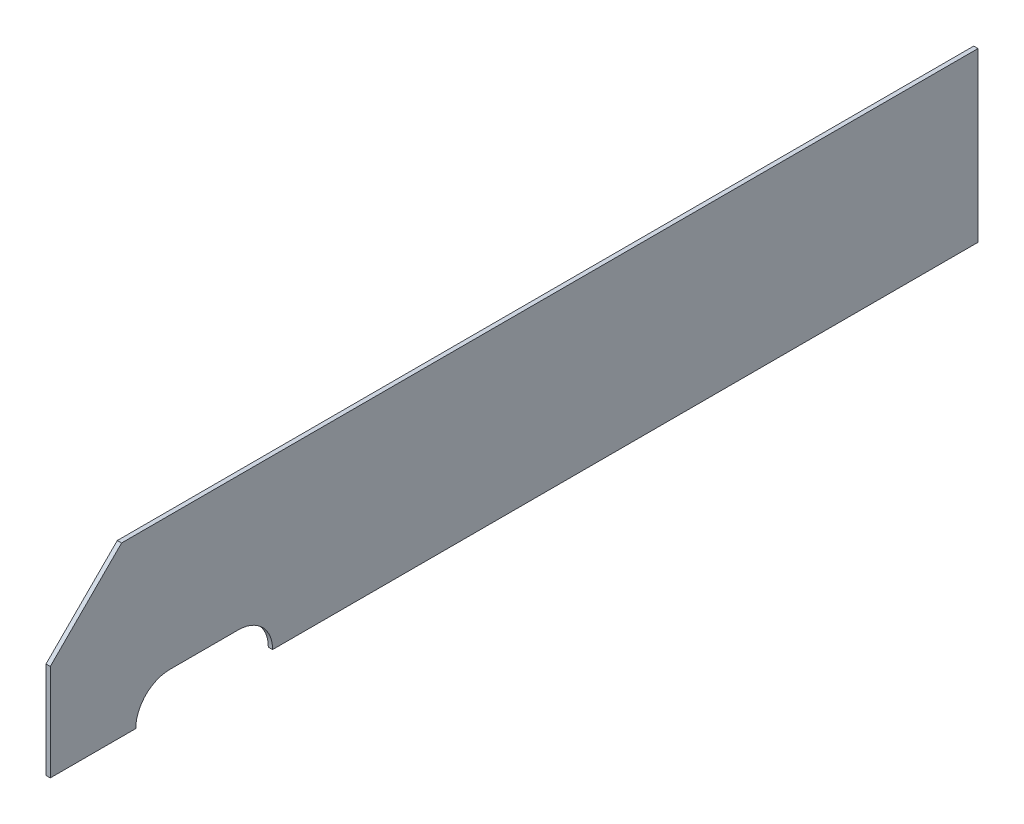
from build123d import *

# Parameters (mm, degrees)
BOSS_EXTRUDE1_DEPTH = 3.175
CUT_EXTRUDE1_DEPTH  = 1449.554277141


with BuildPart() as part:
    # Sketch1 → Boss-Extrude1 (new body)
    with BuildSketch(Plane.ZY.offset(912.202870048)):
        Polygon((1338.639151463, 402.212122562), (1391.590752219, 349.260521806), (1391.590752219, 277.550649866), (702.615752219, 277.550649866), (702.615752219, 402.212122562), align=None)
    extrude(amount=-BOSS_EXTRUDE1_DEPTH)

    # Sketch2 → Cut-Extrude1 (cut, through all)
    with BuildSketch(Plane.ZY.offset(912.202870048)):
        with BuildLine():
            Line((1251.890752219, 302.950649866), (1302.690752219, 302.950649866))
            ThreePointArc((1302.690752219, 302.950649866), (1328.090752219, 277.550649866), (1302.690752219, 252.150649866))
            Line((1302.690752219, 252.150649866), (1251.890752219, 252.150649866))
            ThreePointArc((1251.890752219, 252.150649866), (1226.490752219, 277.550649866), (1251.890752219, 302.950649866))
        make_face()
    extrude(amount=-CUT_EXTRUDE1_DEPTH, mode=Mode.SUBTRACT)


solid = part.part
